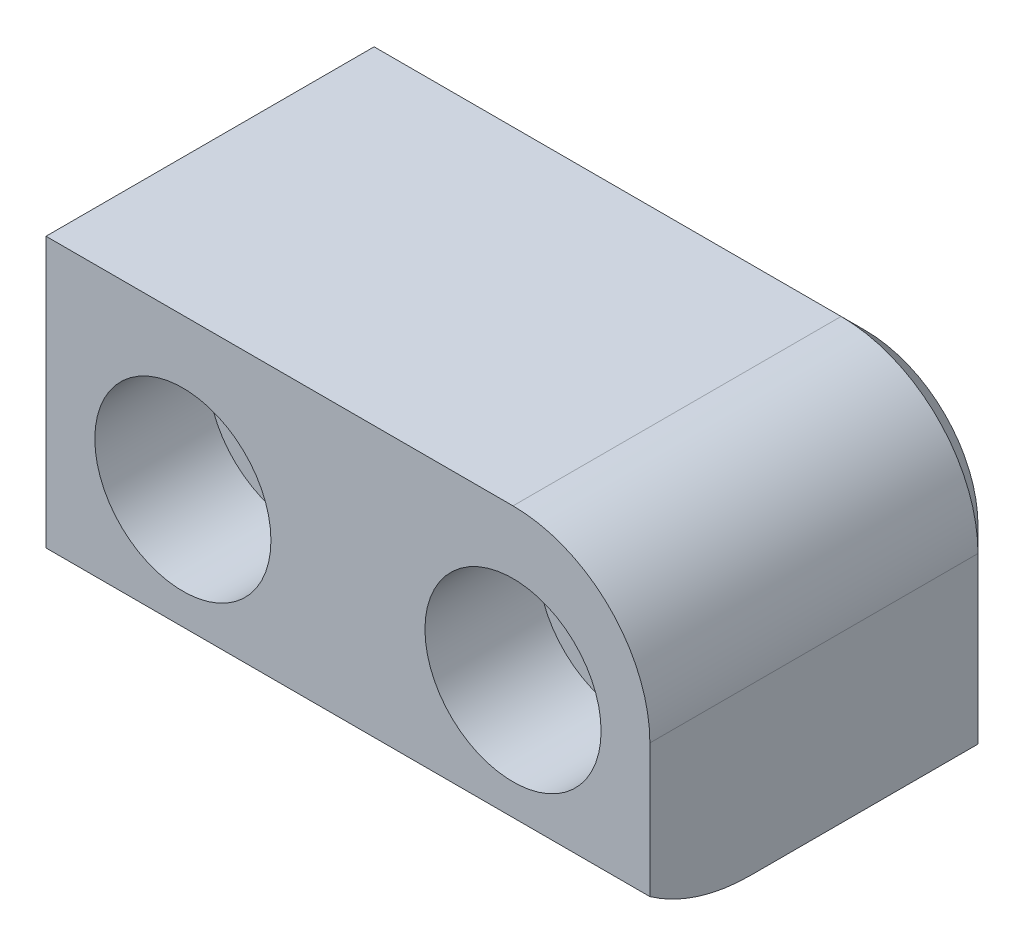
ISO-10303-21;
HEADER;
FILE_DESCRIPTION(('STEP AP214'),'2;1');
FILE_NAME('part.step','',(''),(''),'','','');
FILE_SCHEMA(('AUTOMOTIVE_DESIGN { 1 0 10303 214 1 1 1 1 }'));
ENDSEC;
DATA;
#1=APPLICATION_CONTEXT('core data for automotive mechanical design processes');
#2=APPLICATION_PROTOCOL_DEFINITION('international standard','automotive_design',2000,#1);
#3=PRODUCT_CONTEXT('',#1,'mechanical');
#4=PRODUCT('Part','Part','',(#3));
#5=PRODUCT_RELATED_PRODUCT_CATEGORY('part','',(#4));
#6=PRODUCT_DEFINITION_FORMATION('','',#4);
#7=PRODUCT_DEFINITION_CONTEXT('part definition',#1,'design');
#8=PRODUCT_DEFINITION('design','',#6,#7);
#9=PRODUCT_DEFINITION_SHAPE('','',#8);
#10=(LENGTH_UNIT() NAMED_UNIT(*) SI_UNIT(.MILLI.,.METRE.));
#11=(NAMED_UNIT(*) PLANE_ANGLE_UNIT() SI_UNIT($,.RADIAN.));
#12=(NAMED_UNIT(*) SI_UNIT($,.STERADIAN.) SOLID_ANGLE_UNIT());
#13=UNCERTAINTY_MEASURE_WITH_UNIT(LENGTH_MEASURE(1.E-05),#10,'distance_accuracy_value','');
#14=(GEOMETRIC_REPRESENTATION_CONTEXT(3) GLOBAL_UNCERTAINTY_ASSIGNED_CONTEXT((#13)) GLOBAL_UNIT_ASSIGNED_CONTEXT((#10,
#11,#12)) REPRESENTATION_CONTEXT('',''));
#15=CARTESIAN_POINT('',(0.,0.,0.));
#16=DIRECTION('',(0.,0.,1.));
#17=DIRECTION('',(1.,0.,0.));
#18=AXIS2_PLACEMENT_3D('',#15,#16,#17);
#19=CARTESIAN_POINT('',(0.,19.05,-22.225));
#20=DIRECTION('',(-1.,0.,0.));
#21=DIRECTION('',(0.,-1.,0.));
#22=AXIS2_PLACEMENT_3D('',#19,#20,#21);
#23=PLANE('',#22);
#24=DIRECTION('',(0.,0.,1.));
#25=VECTOR('',#24,1.);
#26=CARTESIAN_POINT('',(0.,19.05,-22.225));
#27=LINE('',#26,#25);
#28=CARTESIAN_POINT('',(0.,19.05,-20.701));
#29=VERTEX_POINT('',#28);
#30=CARTESIAN_POINT('',(0.,19.05,0.));
#31=VERTEX_POINT('',#30);
#32=EDGE_CURVE('E108',#29,#31,#27,.T.);
#33=ORIENTED_EDGE('',*,*,#32,.F.);
#34=DIRECTION('',(0.,-0.707106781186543,-0.707106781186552));
#35=VECTOR('',#34,1.);
#36=CARTESIAN_POINT('',(0.,18.288,-21.463));
#37=LINE('',#36,#35);
#38=CARTESIAN_POINT('',(0.,17.526,-22.225));
#39=VERTEX_POINT('',#38);
#40=EDGE_CURVE('E174',#29,#39,#37,.T.);
#41=ORIENTED_EDGE('',*,*,#40,.T.);
#42=DIRECTION('',(0.,-1.,0.));
#43=VECTOR('',#42,1.);
#44=CARTESIAN_POINT('',(0.,19.05,-22.225));
#45=LINE('',#44,#43);
#46=CARTESIAN_POINT('',(0.,0.,-22.225));
#47=VERTEX_POINT('',#46);
#48=EDGE_CURVE('E152',#39,#47,#45,.T.);
#49=ORIENTED_EDGE('',*,*,#48,.T.);
#50=DIRECTION('',(0.,0.,1.));
#51=VECTOR('',#50,1.);
#52=CARTESIAN_POINT('',(0.,0.,-22.225));
#53=LINE('',#52,#51);
#54=CARTESIAN_POINT('',(0.,0.,-6.35));
#55=VERTEX_POINT('',#54);
#56=EDGE_CURVE('E109',#47,#55,#53,.T.);
#57=ORIENTED_EDGE('',*,*,#56,.T.);
#58=CARTESIAN_POINT('',(0.,11.0049633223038,-6.35000000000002));
#59=DIRECTION('',(1.,0.,0.));
#60=DIRECTION('',(0.,-1.,0.));
#61=AXIS2_PLACEMENT_3D('',#58,#59,#60);
#62=CIRCLE('',#61,11.0049633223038);
#63=CARTESIAN_POINT('',(0.,2.0168201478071,0.));
#64=VERTEX_POINT('',#63);
#65=EDGE_CURVE('E116',#64,#55,#62,.T.);
#66=ORIENTED_EDGE('',*,*,#65,.F.);
#67=DIRECTION('',(0.,-1.,0.));
#68=VECTOR('',#67,1.);
#69=CARTESIAN_POINT('',(0.,19.05,0.));
#70=LINE('',#69,#68);
#71=EDGE_CURVE('E151',#31,#64,#70,.T.);
#72=ORIENTED_EDGE('',*,*,#71,.F.);
#73=EDGE_LOOP('',(#33,#41,#49,#57,#66,#72));
#74=FACE_BOUND('',#73,.T.);
#75=ADVANCED_FACE('F37',(#74),#23,.T.);
#76=CARTESIAN_POINT('',(0.,19.05,-22.225));
#77=DIRECTION('',(0.,1.,0.));
#78=DIRECTION('',(0.,0.,1.));
#79=AXIS2_PLACEMENT_3D('',#76,#77,#78);
#80=PLANE('',#79);
#81=DIRECTION('',(0.,0.,1.));
#82=VECTOR('',#81,1.);
#83=CARTESIAN_POINT('',(29.464,19.05,-22.225));
#84=LINE('',#83,#82);
#85=CARTESIAN_POINT('',(29.464,19.05,0.));
#86=VERTEX_POINT('',#85);
#87=CARTESIAN_POINT('',(29.464,19.05,-20.701));
#88=VERTEX_POINT('',#87);
#89=EDGE_CURVE('E168',#86,#88,#84,.F.);
#90=ORIENTED_EDGE('',*,*,#89,.T.);
#91=DIRECTION('',(-1.,0.,0.));
#92=VECTOR('',#91,1.);
#93=CARTESIAN_POINT('',(0.,19.05,-20.701));
#94=LINE('',#93,#92);
#95=EDGE_CURVE('E171',#88,#29,#94,.T.);
#96=ORIENTED_EDGE('',*,*,#95,.T.);
#97=ORIENTED_EDGE('',*,*,#32,.T.);
#98=DIRECTION('',(-1.,0.,0.));
#99=VECTOR('',#98,1.);
#100=CARTESIAN_POINT('',(0.,19.05,0.));
#101=LINE('',#100,#99);
#102=EDGE_CURVE('E155',#86,#31,#101,.T.);
#103=ORIENTED_EDGE('',*,*,#102,.F.);
#104=EDGE_LOOP('',(#90,#96,#97,#103));
#105=FACE_BOUND('',#104,.T.);
#106=ADVANCED_FACE('F207',(#105),#80,.T.);
#107=CARTESIAN_POINT('',(38.1,19.05,-22.225));
#108=DIRECTION('',(1.,0.,0.));
#109=DIRECTION('',(0.,1.,0.));
#110=AXIS2_PLACEMENT_3D('',#107,#108,#109);
#111=PLANE('',#110);
#112=DIRECTION('',(0.,0.,1.));
#113=VECTOR('',#112,1.);
#114=CARTESIAN_POINT('',(38.1,0.,-22.225));
#115=LINE('',#114,#113);
#116=CARTESIAN_POINT('',(38.1,0.,-20.701));
#117=VERTEX_POINT('',#116);
#118=CARTESIAN_POINT('',(38.1,0.,-6.35));
#119=VERTEX_POINT('',#118);
#120=EDGE_CURVE('E101',#117,#119,#115,.T.);
#121=ORIENTED_EDGE('',*,*,#120,.F.);
#122=DIRECTION('',(0.,1.,0.));
#123=VECTOR('',#122,1.);
#124=CARTESIAN_POINT('',(38.1,10.414,-20.701));
#125=LINE('',#124,#123);
#126=CARTESIAN_POINT('',(38.1,10.414,-20.701));
#127=VERTEX_POINT('',#126);
#128=EDGE_CURVE('E54',#117,#127,#125,.T.);
#129=ORIENTED_EDGE('',*,*,#128,.T.);
#130=DIRECTION('',(0.,0.,1.));
#131=VECTOR('',#130,1.);
#132=CARTESIAN_POINT('',(38.1,10.414,-22.225));
#133=LINE('',#132,#131);
#134=CARTESIAN_POINT('',(38.1,10.414,0.));
#135=VERTEX_POINT('',#134);
#136=EDGE_CURVE('E162',#127,#135,#133,.T.);
#137=ORIENTED_EDGE('',*,*,#136,.T.);
#138=DIRECTION('',(0.,1.,0.));
#139=VECTOR('',#138,1.);
#140=CARTESIAN_POINT('',(38.1,19.05,0.));
#141=LINE('',#140,#139);
#142=CARTESIAN_POINT('',(38.1,2.01682014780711,0.));
#143=VERTEX_POINT('',#142);
#144=EDGE_CURVE('E123',#143,#135,#141,.T.);
#145=ORIENTED_EDGE('',*,*,#144,.F.);
#146=CARTESIAN_POINT('',(38.1,11.0049633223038,-6.35000000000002));
#147=DIRECTION('',(1.,0.,0.));
#148=DIRECTION('',(0.,-1.,0.));
#149=AXIS2_PLACEMENT_3D('',#146,#147,#148);
#150=CIRCLE('',#149,11.0049633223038);
#151=EDGE_CURVE('E113',#143,#119,#150,.T.);
#152=ORIENTED_EDGE('',*,*,#151,.T.);
#153=EDGE_LOOP('',(#121,#129,#137,#145,#152));
#154=FACE_BOUND('',#153,.T.);
#155=ADVANCED_FACE('F121',(#154),#111,.T.);
#156=CARTESIAN_POINT('',(0.,0.,-22.225));
#157=DIRECTION('',(0.,-1.,0.));
#158=DIRECTION('',(0.,0.,-1.));
#159=AXIS2_PLACEMENT_3D('',#156,#157,#158);
#160=PLANE('',#159);
#161=DIRECTION('',(1.,0.,0.));
#162=VECTOR('',#161,1.);
#163=CARTESIAN_POINT('',(0.,0.,-22.225));
#164=LINE('',#163,#162);
#165=CARTESIAN_POINT('',(36.576,0.,-22.225));
#166=VERTEX_POINT('',#165);
#167=EDGE_CURVE('E154',#47,#166,#164,.T.);
#168=ORIENTED_EDGE('',*,*,#167,.T.);
#169=DIRECTION('',(0.707106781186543,0.,0.707106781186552));
#170=VECTOR('',#169,1.);
#171=CARTESIAN_POINT('',(18.2880000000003,0.,-40.513));
#172=LINE('',#171,#170);
#173=EDGE_CURVE('E46',#166,#117,#172,.T.);
#174=ORIENTED_EDGE('',*,*,#173,.T.);
#175=ORIENTED_EDGE('',*,*,#120,.T.);
#176=DIRECTION('',(-1.,0.,0.));
#177=VECTOR('',#176,1.);
#178=CARTESIAN_POINT('',(38.1,0.,-6.35));
#179=LINE('',#178,#177);
#180=EDGE_CURVE('E105',#119,#55,#179,.T.);
#181=ORIENTED_EDGE('',*,*,#180,.T.);
#182=ORIENTED_EDGE('',*,*,#56,.F.);
#183=EDGE_LOOP('',(#168,#174,#175,#181,#182));
#184=FACE_BOUND('',#183,.T.);
#185=ADVANCED_FACE('F103',(#184),#160,.T.);
#186=CARTESIAN_POINT('',(0.,0.,-22.225));
#187=DIRECTION('',(0.,0.,1.));
#188=DIRECTION('',(1.,0.,0.));
#189=AXIS2_PLACEMENT_3D('',#186,#187,#188);
#190=PLANE('',#189);
#191=ORIENTED_EDGE('',*,*,#48,.F.);
#192=DIRECTION('',(1.,0.,0.));
#193=VECTOR('',#192,1.);
#194=CARTESIAN_POINT('',(29.464,17.526,-22.225));
#195=LINE('',#194,#193);
#196=CARTESIAN_POINT('',(29.464,17.526,-22.225));
#197=VERTEX_POINT('',#196);
#198=EDGE_CURVE('E180',#39,#197,#195,.T.);
#199=ORIENTED_EDGE('',*,*,#198,.T.);
#200=CARTESIAN_POINT('',(29.464,10.414,-22.225));
#201=DIRECTION('',(0.,0.,1.));
#202=DIRECTION('',(1.,0.,0.));
#203=AXIS2_PLACEMENT_3D('',#200,#201,#202);
#204=CIRCLE('',#203,7.11200000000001);
#205=CARTESIAN_POINT('',(36.576,10.414,-22.225));
#206=VERTEX_POINT('',#205);
#207=EDGE_CURVE('E176',#197,#206,#204,.F.);
#208=ORIENTED_EDGE('',*,*,#207,.T.);
#209=DIRECTION('',(0.,-1.,0.));
#210=VECTOR('',#209,1.);
#211=CARTESIAN_POINT('',(36.576,0.,-22.225));
#212=LINE('',#211,#210);
#213=EDGE_CURVE('E178',#206,#166,#212,.T.);
#214=ORIENTED_EDGE('',*,*,#213,.T.);
#215=ORIENTED_EDGE('',*,*,#167,.F.);
#216=EDGE_LOOP('',(#191,#199,#208,#214,#215));
#217=FACE_BOUND('',#216,.T.);
#218=CARTESIAN_POINT('',(8.636,9.525,-22.225));
#219=DIRECTION('',(0.,0.,1.));
#220=DIRECTION('',(1.,0.,0.));
#221=AXIS2_PLACEMENT_3D('',#218,#219,#220);
#222=CIRCLE('',#221,3.2639);
#223=CARTESIAN_POINT('',(11.8999,9.525,-22.225));
#224=VERTEX_POINT('',#223);
#225=EDGE_CURVE('E136',#224,#224,#222,.T.);
#226=ORIENTED_EDGE('',*,*,#225,.T.);
#227=EDGE_LOOP('',(#226));
#228=FACE_BOUND('',#227,.T.);
#229=CARTESIAN_POINT('',(29.464,9.525,-22.225));
#230=DIRECTION('',(0.,0.,1.));
#231=DIRECTION('',(1.,0.,0.));
#232=AXIS2_PLACEMENT_3D('',#229,#230,#231);
#233=CIRCLE('',#232,3.26389999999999);
#234=CARTESIAN_POINT('',(32.7279,9.525,-22.225));
#235=VERTEX_POINT('',#234);
#236=EDGE_CURVE('E148',#235,#235,#233,.T.);
#237=ORIENTED_EDGE('',*,*,#236,.T.);
#238=EDGE_LOOP('',(#237));
#239=FACE_BOUND('',#238,.T.);
#240=ADVANCED_FACE('F200',(#217,#228,#239),#190,.F.);
#241=CARTESIAN_POINT('',(0.,0.,0.));
#242=DIRECTION('',(0.,0.,1.));
#243=DIRECTION('',(1.,0.,0.));
#244=AXIS2_PLACEMENT_3D('',#241,#242,#243);
#245=PLANE('',#244);
#246=DIRECTION('',(-1.,0.,0.));
#247=VECTOR('',#246,1.);
#248=CARTESIAN_POINT('',(38.1,2.0168201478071,0.));
#249=LINE('',#248,#247);
#250=EDGE_CURVE('E118',#143,#64,#249,.T.);
#251=ORIENTED_EDGE('',*,*,#250,.F.);
#252=ORIENTED_EDGE('',*,*,#144,.T.);
#253=CARTESIAN_POINT('',(29.464,10.414,0.));
#254=DIRECTION('',(0.,0.,1.));
#255=DIRECTION('',(1.,0.,0.));
#256=AXIS2_PLACEMENT_3D('',#253,#254,#255);
#257=CIRCLE('',#256,8.636);
#258=EDGE_CURVE('E166',#135,#86,#257,.T.);
#259=ORIENTED_EDGE('',*,*,#258,.T.);
#260=ORIENTED_EDGE('',*,*,#102,.T.);
#261=ORIENTED_EDGE('',*,*,#71,.T.);
#262=EDGE_LOOP('',(#251,#252,#259,#260,#261));
#263=FACE_BOUND('',#262,.T.);
#264=CARTESIAN_POINT('',(8.636,9.525,0.));
#265=DIRECTION('',(0.,0.,1.));
#266=DIRECTION('',(1.,0.,0.));
#267=AXIS2_PLACEMENT_3D('',#264,#265,#266);
#268=CIRCLE('',#267,5.55625);
#269=CARTESIAN_POINT('',(14.19225,9.525,0.));
#270=VERTEX_POINT('',#269);
#271=EDGE_CURVE('E117',#270,#270,#268,.T.);
#272=ORIENTED_EDGE('',*,*,#271,.F.);
#273=EDGE_LOOP('',(#272));
#274=FACE_BOUND('',#273,.T.);
#275=CARTESIAN_POINT('',(29.464,9.525,0.));
#276=DIRECTION('',(0.,0.,1.));
#277=DIRECTION('',(1.,0.,0.));
#278=AXIS2_PLACEMENT_3D('',#275,#276,#277);
#279=CIRCLE('',#278,5.55625);
#280=CARTESIAN_POINT('',(35.02025,9.525,0.));
#281=VERTEX_POINT('',#280);
#282=EDGE_CURVE('E139',#281,#281,#279,.T.);
#283=ORIENTED_EDGE('',*,*,#282,.F.);
#284=EDGE_LOOP('',(#283));
#285=FACE_BOUND('',#284,.T.);
#286=ADVANCED_FACE('F211',(#263,#274,#285),#245,.T.);
#287=CARTESIAN_POINT('',(29.464,10.414,-22.225));
#288=DIRECTION('',(0.,0.,1.));
#289=DIRECTION('',(1.,0.,0.));
#290=AXIS2_PLACEMENT_3D('',#287,#288,#289);
#291=CYLINDRICAL_SURFACE('',#290,8.636);
#292=ORIENTED_EDGE('',*,*,#136,.F.);
#293=CARTESIAN_POINT('',(29.464,10.414,-20.701));
#294=DIRECTION('',(0.,0.,1.));
#295=DIRECTION('',(1.,0.,0.));
#296=AXIS2_PLACEMENT_3D('',#293,#294,#295);
#297=CIRCLE('',#296,8.636);
#298=EDGE_CURVE('E11',#127,#88,#297,.T.);
#299=ORIENTED_EDGE('',*,*,#298,.T.);
#300=ORIENTED_EDGE('',*,*,#89,.F.);
#301=ORIENTED_EDGE('',*,*,#258,.F.);
#302=EDGE_LOOP('',(#292,#299,#300,#301));
#303=FACE_BOUND('',#302,.T.);
#304=ADVANCED_FACE('F215',(#303),#291,.T.);
#305=CARTESIAN_POINT('',(29.464,9.525,0.));
#306=DIRECTION('',(0.,0.,1.));
#307=DIRECTION('',(1.,0.,0.));
#308=AXIS2_PLACEMENT_3D('',#305,#306,#307);
#309=CYLINDRICAL_SURFACE('',#308,3.2639);
#310=ORIENTED_EDGE('',*,*,#236,.F.);
#311=EDGE_LOOP('',(#310));
#312=FACE_BOUND('',#311,.T.);
#313=CARTESIAN_POINT('',(29.464,9.525,-7.14502));
#314=DIRECTION('',(0.,0.,1.));
#315=DIRECTION('',(1.,0.,0.));
#316=AXIS2_PLACEMENT_3D('',#313,#314,#315);
#317=CIRCLE('',#316,3.2639);
#318=CARTESIAN_POINT('',(32.7279,9.525,-7.14502));
#319=VERTEX_POINT('',#318);
#320=EDGE_CURVE('E145',#319,#319,#317,.T.);
#321=ORIENTED_EDGE('',*,*,#320,.T.);
#322=EDGE_LOOP('',(#321));
#323=FACE_BOUND('',#322,.T.);
#324=ADVANCED_FACE('F217',(#312,#323),#309,.F.);
#325=CARTESIAN_POINT('',(32.7279,9.525,-7.14502));
#326=DIRECTION('',(0.,0.,-1.));
#327=DIRECTION('',(-1.,0.,0.));
#328=AXIS2_PLACEMENT_3D('',#325,#326,#327);
#329=PLANE('',#328);
#330=ORIENTED_EDGE('',*,*,#320,.F.);
#331=EDGE_LOOP('',(#330));
#332=FACE_BOUND('',#331,.T.);
#333=CARTESIAN_POINT('',(29.464,9.525,-7.14502));
#334=DIRECTION('',(0.,0.,1.));
#335=DIRECTION('',(1.,0.,0.));
#336=AXIS2_PLACEMENT_3D('',#333,#334,#335);
#337=CIRCLE('',#336,5.55625);
#338=CARTESIAN_POINT('',(35.02025,9.525,-7.14502));
#339=VERTEX_POINT('',#338);
#340=EDGE_CURVE('E142',#339,#339,#337,.T.);
#341=ORIENTED_EDGE('',*,*,#340,.T.);
#342=EDGE_LOOP('',(#341));
#343=FACE_BOUND('',#342,.T.);
#344=ADVANCED_FACE('F223',(#332,#343),#329,.F.);
#345=CARTESIAN_POINT('',(29.464,9.525,0.));
#346=DIRECTION('',(0.,0.,1.));
#347=DIRECTION('',(1.,0.,0.));
#348=AXIS2_PLACEMENT_3D('',#345,#346,#347);
#349=CYLINDRICAL_SURFACE('',#348,5.55625);
#350=ORIENTED_EDGE('',*,*,#340,.F.);
#351=EDGE_LOOP('',(#350));
#352=FACE_BOUND('',#351,.T.);
#353=ORIENTED_EDGE('',*,*,#282,.T.);
#354=EDGE_LOOP('',(#353));
#355=FACE_BOUND('',#354,.T.);
#356=ADVANCED_FACE('F243',(#352,#355),#349,.F.);
#357=CARTESIAN_POINT('',(8.636,9.525,0.));
#358=DIRECTION('',(0.,0.,1.));
#359=DIRECTION('',(1.,0.,0.));
#360=AXIS2_PLACEMENT_3D('',#357,#358,#359);
#361=CYLINDRICAL_SURFACE('',#360,3.2639);
#362=ORIENTED_EDGE('',*,*,#225,.F.);
#363=EDGE_LOOP('',(#362));
#364=FACE_BOUND('',#363,.T.);
#365=CARTESIAN_POINT('',(8.636,9.525,-7.14502));
#366=DIRECTION('',(0.,0.,1.));
#367=DIRECTION('',(1.,0.,0.));
#368=AXIS2_PLACEMENT_3D('',#365,#366,#367);
#369=CIRCLE('',#368,3.2639);
#370=CARTESIAN_POINT('',(11.8999,9.525,-7.14502));
#371=VERTEX_POINT('',#370);
#372=EDGE_CURVE('E133',#371,#371,#369,.T.);
#373=ORIENTED_EDGE('',*,*,#372,.T.);
#374=EDGE_LOOP('',(#373));
#375=FACE_BOUND('',#374,.T.);
#376=ADVANCED_FACE('F247',(#364,#375),#361,.F.);
#377=CARTESIAN_POINT('',(11.8999,9.525,-7.14502));
#378=DIRECTION('',(0.,0.,-1.));
#379=DIRECTION('',(-1.,0.,0.));
#380=AXIS2_PLACEMENT_3D('',#377,#378,#379);
#381=PLANE('',#380);
#382=ORIENTED_EDGE('',*,*,#372,.F.);
#383=EDGE_LOOP('',(#382));
#384=FACE_BOUND('',#383,.T.);
#385=CARTESIAN_POINT('',(8.636,9.525,-7.14502));
#386=DIRECTION('',(0.,0.,1.));
#387=DIRECTION('',(1.,0.,0.));
#388=AXIS2_PLACEMENT_3D('',#385,#386,#387);
#389=CIRCLE('',#388,5.55625);
#390=CARTESIAN_POINT('',(14.19225,9.525,-7.14502));
#391=VERTEX_POINT('',#390);
#392=EDGE_CURVE('E130',#391,#391,#389,.T.);
#393=ORIENTED_EDGE('',*,*,#392,.T.);
#394=EDGE_LOOP('',(#393));
#395=FACE_BOUND('',#394,.T.);
#396=ADVANCED_FACE('F251',(#384,#395),#381,.F.);
#397=CARTESIAN_POINT('',(8.636,9.525,0.));
#398=DIRECTION('',(0.,0.,1.));
#399=DIRECTION('',(1.,0.,0.));
#400=AXIS2_PLACEMENT_3D('',#397,#398,#399);
#401=CYLINDRICAL_SURFACE('',#400,5.55625);
#402=ORIENTED_EDGE('',*,*,#392,.F.);
#403=EDGE_LOOP('',(#402));
#404=FACE_BOUND('',#403,.T.);
#405=ORIENTED_EDGE('',*,*,#271,.T.);
#406=EDGE_LOOP('',(#405));
#407=FACE_BOUND('',#406,.T.);
#408=ADVANCED_FACE('F255',(#404,#407),#401,.F.);
#409=CARTESIAN_POINT('',(38.1,11.0049633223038,-6.35000000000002));
#410=DIRECTION('',(-1.,0.,0.));
#411=DIRECTION('',(0.,-1.,0.));
#412=AXIS2_PLACEMENT_3D('',#409,#410,#411);
#413=CYLINDRICAL_SURFACE('',#412,11.0049633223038);
#414=ORIENTED_EDGE('',*,*,#65,.T.);
#415=ORIENTED_EDGE('',*,*,#180,.F.);
#416=ORIENTED_EDGE('',*,*,#151,.F.);
#417=ORIENTED_EDGE('',*,*,#250,.T.);
#418=EDGE_LOOP('',(#414,#415,#416,#417));
#419=FACE_BOUND('',#418,.T.);
#420=ADVANCED_FACE('F112',(#419),#413,.T.);
#421=CARTESIAN_POINT('',(38.1,19.05,-20.701));
#422=DIRECTION('',(0.707106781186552,0.,-0.707106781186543));
#423=DIRECTION('',(0.,-1.,0.));
#424=AXIS2_PLACEMENT_3D('',#421,#422,#423);
#425=PLANE('',#424);
#426=ORIENTED_EDGE('',*,*,#173,.F.);
#427=ORIENTED_EDGE('',*,*,#213,.F.);
#428=DIRECTION('',(-0.707106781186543,0.,-0.707106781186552));
#429=VECTOR('',#428,1.);
#430=CARTESIAN_POINT('',(38.1,10.414,-20.701));
#431=LINE('',#430,#429);
#432=EDGE_CURVE('E41',#127,#206,#431,.T.);
#433=ORIENTED_EDGE('',*,*,#432,.F.);
#434=ORIENTED_EDGE('',*,*,#128,.F.);
#435=EDGE_LOOP('',(#426,#427,#433,#434));
#436=FACE_BOUND('',#435,.T.);
#437=ADVANCED_FACE('F39',(#436),#425,.T.);
#438=CARTESIAN_POINT('',(29.464,10.414,-22.225));
#439=DIRECTION('',(0.,0.,1.));
#440=DIRECTION('',(1.,0.,0.));
#441=AXIS2_PLACEMENT_3D('',#438,#439,#440);
#442=CONICAL_SURFACE('',#441,7.11200000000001,0.785398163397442);
#443=ORIENTED_EDGE('',*,*,#432,.T.);
#444=ORIENTED_EDGE('',*,*,#207,.F.);
#445=DIRECTION('',(0.,-0.707106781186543,-0.707106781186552));
#446=VECTOR('',#445,1.);
#447=CARTESIAN_POINT('',(29.464,19.05,-20.701));
#448=LINE('',#447,#446);
#449=EDGE_CURVE('E183',#88,#197,#448,.T.);
#450=ORIENTED_EDGE('',*,*,#449,.F.);
#451=ORIENTED_EDGE('',*,*,#298,.F.);
#452=EDGE_LOOP('',(#443,#444,#450,#451));
#453=FACE_BOUND('',#452,.T.);
#454=ADVANCED_FACE('F194',(#453),#442,.T.);
#455=CARTESIAN_POINT('',(0.,19.05,-20.701));
#456=DIRECTION('',(0.,0.707106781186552,-0.707106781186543));
#457=DIRECTION('',(1.,0.,0.));
#458=AXIS2_PLACEMENT_3D('',#455,#456,#457);
#459=PLANE('',#458);
#460=ORIENTED_EDGE('',*,*,#449,.T.);
#461=ORIENTED_EDGE('',*,*,#198,.F.);
#462=ORIENTED_EDGE('',*,*,#40,.F.);
#463=ORIENTED_EDGE('',*,*,#95,.F.);
#464=EDGE_LOOP('',(#460,#461,#462,#463));
#465=FACE_BOUND('',#464,.T.);
#466=ADVANCED_FACE('F205',(#465),#459,.T.);
#467=CLOSED_SHELL('',(#75,#106,#155,#185,#240,#286,#304,#324,#344,#356,#376,#396,#408,#420,#437,
#454,#466));
#468=MANIFOLD_SOLID_BREP('B2',#467);
#469=ADVANCED_BREP_SHAPE_REPRESENTATION('',(#18,#468),#14);
#470=SHAPE_DEFINITION_REPRESENTATION(#9,#469);
ENDSEC;
END-ISO-10303-21;
